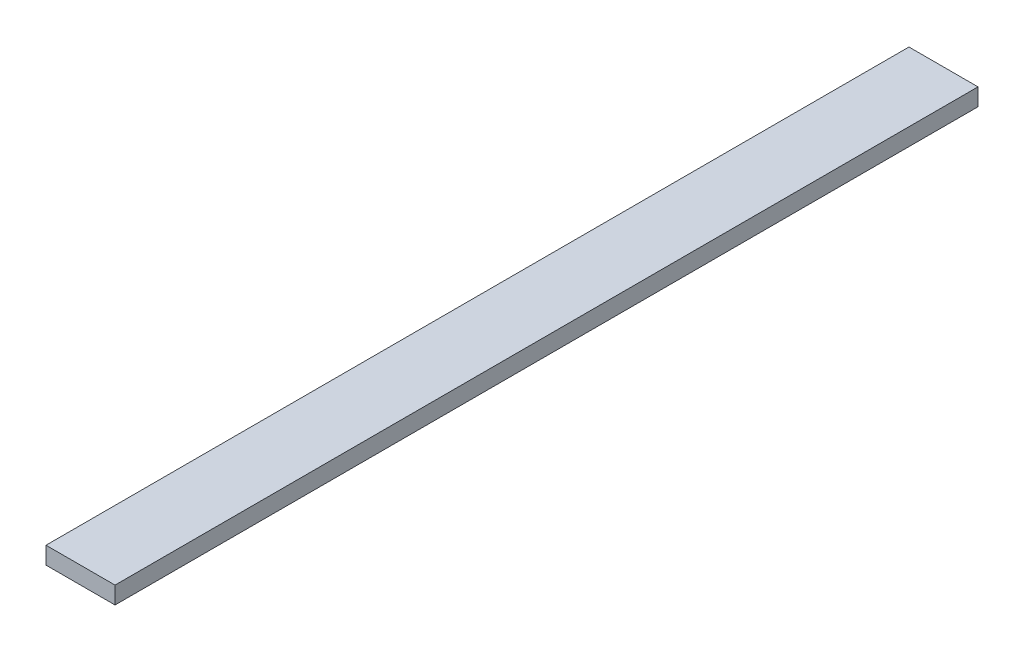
ISO-10303-21;
HEADER;
FILE_DESCRIPTION(('STEP AP214'),'2;1');
FILE_NAME('part.step','',(''),(''),'','','');
FILE_SCHEMA(('AUTOMOTIVE_DESIGN { 1 0 10303 214 1 1 1 1 }'));
ENDSEC;
DATA;
#1=APPLICATION_CONTEXT('core data for automotive mechanical design processes');
#2=APPLICATION_PROTOCOL_DEFINITION('international standard','automotive_design',2000,#1);
#3=PRODUCT_CONTEXT('',#1,'mechanical');
#4=PRODUCT('Part','Part','',(#3));
#5=PRODUCT_RELATED_PRODUCT_CATEGORY('part','',(#4));
#6=PRODUCT_DEFINITION_FORMATION('','',#4);
#7=PRODUCT_DEFINITION_CONTEXT('part definition',#1,'design');
#8=PRODUCT_DEFINITION('design','',#6,#7);
#9=PRODUCT_DEFINITION_SHAPE('','',#8);
#10=(LENGTH_UNIT() NAMED_UNIT(*) SI_UNIT(.MILLI.,.METRE.));
#11=(NAMED_UNIT(*) PLANE_ANGLE_UNIT() SI_UNIT($,.RADIAN.));
#12=(NAMED_UNIT(*) SI_UNIT($,.STERADIAN.) SOLID_ANGLE_UNIT());
#13=UNCERTAINTY_MEASURE_WITH_UNIT(LENGTH_MEASURE(1.E-05),#10,'distance_accuracy_value','');
#14=(GEOMETRIC_REPRESENTATION_CONTEXT(3) GLOBAL_UNCERTAINTY_ASSIGNED_CONTEXT((#13)) GLOBAL_UNIT_ASSIGNED_CONTEXT((#10,
#11,#12)) REPRESENTATION_CONTEXT('',''));
#15=CARTESIAN_POINT('',(0.,0.,0.));
#16=DIRECTION('',(0.,0.,1.));
#17=DIRECTION('',(1.,0.,0.));
#18=AXIS2_PLACEMENT_3D('',#15,#16,#17);
#19=CARTESIAN_POINT('',(0.,0.,100.));
#20=DIRECTION('',(1.,0.,0.));
#21=DIRECTION('',(0.,0.,-1.));
#22=AXIS2_PLACEMENT_3D('',#19,#20,#21);
#23=PLANE('',#22);
#24=DIRECTION('',(0.,-1.,0.));
#25=VECTOR('',#24,1.);
#26=CARTESIAN_POINT('',(0.,0.,0.));
#27=LINE('',#26,#25);
#28=CARTESIAN_POINT('',(0.,2.,0.));
#29=VERTEX_POINT('',#28);
#30=CARTESIAN_POINT('',(0.,0.,0.));
#31=VERTEX_POINT('',#30);
#32=EDGE_CURVE('E70',#29,#31,#27,.T.);
#33=ORIENTED_EDGE('',*,*,#32,.T.);
#34=DIRECTION('',(0.,0.,-1.));
#35=VECTOR('',#34,1.);
#36=CARTESIAN_POINT('',(0.,0.,100.));
#37=LINE('',#36,#35);
#38=CARTESIAN_POINT('',(0.,0.,100.));
#39=VERTEX_POINT('',#38);
#40=EDGE_CURVE('E11',#39,#31,#37,.T.);
#41=ORIENTED_EDGE('',*,*,#40,.F.);
#42=DIRECTION('',(0.,-1.,0.));
#43=VECTOR('',#42,1.);
#44=CARTESIAN_POINT('',(0.,0.,100.));
#45=LINE('',#44,#43);
#46=CARTESIAN_POINT('',(0.,2.,100.));
#47=VERTEX_POINT('',#46);
#48=EDGE_CURVE('E88',#47,#39,#45,.T.);
#49=ORIENTED_EDGE('',*,*,#48,.F.);
#50=DIRECTION('',(0.,0.,-1.));
#51=VECTOR('',#50,1.);
#52=CARTESIAN_POINT('',(0.,2.,100.));
#53=LINE('',#52,#51);
#54=EDGE_CURVE('E82',#47,#29,#53,.T.);
#55=ORIENTED_EDGE('',*,*,#54,.T.);
#56=EDGE_LOOP('',(#33,#41,#49,#55));
#57=FACE_BOUND('',#56,.T.);
#58=ADVANCED_FACE('F26',(#57),#23,.F.);
#59=CARTESIAN_POINT('',(0.,0.,100.));
#60=DIRECTION('',(0.,1.,0.));
#61=DIRECTION('',(0.,0.,1.));
#62=AXIS2_PLACEMENT_3D('',#59,#60,#61);
#63=PLANE('',#62);
#64=DIRECTION('',(1.,0.,0.));
#65=VECTOR('',#64,1.);
#66=CARTESIAN_POINT('',(0.,0.,0.));
#67=LINE('',#66,#65);
#68=CARTESIAN_POINT('',(8.,0.,0.));
#69=VERTEX_POINT('',#68);
#70=EDGE_CURVE('E66',#31,#69,#67,.T.);
#71=ORIENTED_EDGE('',*,*,#70,.T.);
#72=DIRECTION('',(0.,0.,-1.));
#73=VECTOR('',#72,1.);
#74=CARTESIAN_POINT('',(8.,0.,100.));
#75=LINE('',#74,#73);
#76=CARTESIAN_POINT('',(8.,0.,100.));
#77=VERTEX_POINT('',#76);
#78=EDGE_CURVE('E33',#77,#69,#75,.T.);
#79=ORIENTED_EDGE('',*,*,#78,.F.);
#80=DIRECTION('',(1.,0.,0.));
#81=VECTOR('',#80,1.);
#82=CARTESIAN_POINT('',(0.,0.,100.));
#83=LINE('',#82,#81);
#84=EDGE_CURVE('E78',#39,#77,#83,.T.);
#85=ORIENTED_EDGE('',*,*,#84,.F.);
#86=ORIENTED_EDGE('',*,*,#40,.T.);
#87=EDGE_LOOP('',(#71,#79,#85,#86));
#88=FACE_BOUND('',#87,.T.);
#89=ADVANCED_FACE('F77',(#88),#63,.F.);
#90=CARTESIAN_POINT('',(8.,0.,100.));
#91=DIRECTION('',(-1.,0.,0.));
#92=DIRECTION('',(0.,0.,1.));
#93=AXIS2_PLACEMENT_3D('',#90,#91,#92);
#94=PLANE('',#93);
#95=DIRECTION('',(0.,1.,0.));
#96=VECTOR('',#95,1.);
#97=CARTESIAN_POINT('',(8.,0.,0.));
#98=LINE('',#97,#96);
#99=CARTESIAN_POINT('',(8.,2.,0.));
#100=VERTEX_POINT('',#99);
#101=EDGE_CURVE('E71',#69,#100,#98,.T.);
#102=ORIENTED_EDGE('',*,*,#101,.T.);
#103=DIRECTION('',(0.,0.,-1.));
#104=VECTOR('',#103,1.);
#105=CARTESIAN_POINT('',(8.,2.,100.));
#106=LINE('',#105,#104);
#107=CARTESIAN_POINT('',(8.,2.,100.));
#108=VERTEX_POINT('',#107);
#109=EDGE_CURVE('E94',#108,#100,#106,.T.);
#110=ORIENTED_EDGE('',*,*,#109,.F.);
#111=DIRECTION('',(0.,1.,0.));
#112=VECTOR('',#111,1.);
#113=CARTESIAN_POINT('',(8.,0.,100.));
#114=LINE('',#113,#112);
#115=EDGE_CURVE('E45',#77,#108,#114,.T.);
#116=ORIENTED_EDGE('',*,*,#115,.F.);
#117=ORIENTED_EDGE('',*,*,#78,.T.);
#118=EDGE_LOOP('',(#102,#110,#116,#117));
#119=FACE_BOUND('',#118,.T.);
#120=ADVANCED_FACE('F97',(#119),#94,.F.);
#121=CARTESIAN_POINT('',(0.,2.,100.));
#122=DIRECTION('',(0.,-1.,0.));
#123=DIRECTION('',(0.,0.,-1.));
#124=AXIS2_PLACEMENT_3D('',#121,#122,#123);
#125=PLANE('',#124);
#126=DIRECTION('',(-1.,0.,0.));
#127=VECTOR('',#126,1.);
#128=CARTESIAN_POINT('',(0.,2.,0.));
#129=LINE('',#128,#127);
#130=EDGE_CURVE('E86',#100,#29,#129,.T.);
#131=ORIENTED_EDGE('',*,*,#130,.T.);
#132=ORIENTED_EDGE('',*,*,#54,.F.);
#133=DIRECTION('',(-1.,0.,0.));
#134=VECTOR('',#133,1.);
#135=CARTESIAN_POINT('',(0.,2.,100.));
#136=LINE('',#135,#134);
#137=EDGE_CURVE('E40',#108,#47,#136,.T.);
#138=ORIENTED_EDGE('',*,*,#137,.F.);
#139=ORIENTED_EDGE('',*,*,#109,.T.);
#140=EDGE_LOOP('',(#131,#132,#138,#139));
#141=FACE_BOUND('',#140,.T.);
#142=ADVANCED_FACE('F99',(#141),#125,.F.);
#143=CARTESIAN_POINT('',(0.,2.,100.));
#144=DIRECTION('',(0.,0.,-1.));
#145=DIRECTION('',(-1.,0.,0.));
#146=AXIS2_PLACEMENT_3D('',#143,#144,#145);
#147=PLANE('',#146);
#148=ORIENTED_EDGE('',*,*,#48,.T.);
#149=ORIENTED_EDGE('',*,*,#84,.T.);
#150=ORIENTED_EDGE('',*,*,#115,.T.);
#151=ORIENTED_EDGE('',*,*,#137,.T.);
#152=EDGE_LOOP('',(#148,#149,#150,#151));
#153=FACE_BOUND('',#152,.T.);
#154=ADVANCED_FACE('F100',(#153),#147,.F.);
#155=CARTESIAN_POINT('',(0.,2.,0.));
#156=DIRECTION('',(0.,0.,-1.));
#157=DIRECTION('',(-1.,0.,0.));
#158=AXIS2_PLACEMENT_3D('',#155,#156,#157);
#159=PLANE('',#158);
#160=ORIENTED_EDGE('',*,*,#32,.F.);
#161=ORIENTED_EDGE('',*,*,#130,.F.);
#162=ORIENTED_EDGE('',*,*,#101,.F.);
#163=ORIENTED_EDGE('',*,*,#70,.F.);
#164=EDGE_LOOP('',(#160,#161,#162,#163));
#165=FACE_BOUND('',#164,.T.);
#166=ADVANCED_FACE('F67',(#165),#159,.T.);
#167=CLOSED_SHELL('',(#58,#89,#120,#142,#154,#166));
#168=MANIFOLD_SOLID_BREP('B2',#167);
#169=ADVANCED_BREP_SHAPE_REPRESENTATION('',(#18,#168),#14);
#170=SHAPE_DEFINITION_REPRESENTATION(#9,#169);
ENDSEC;
END-ISO-10303-21;
